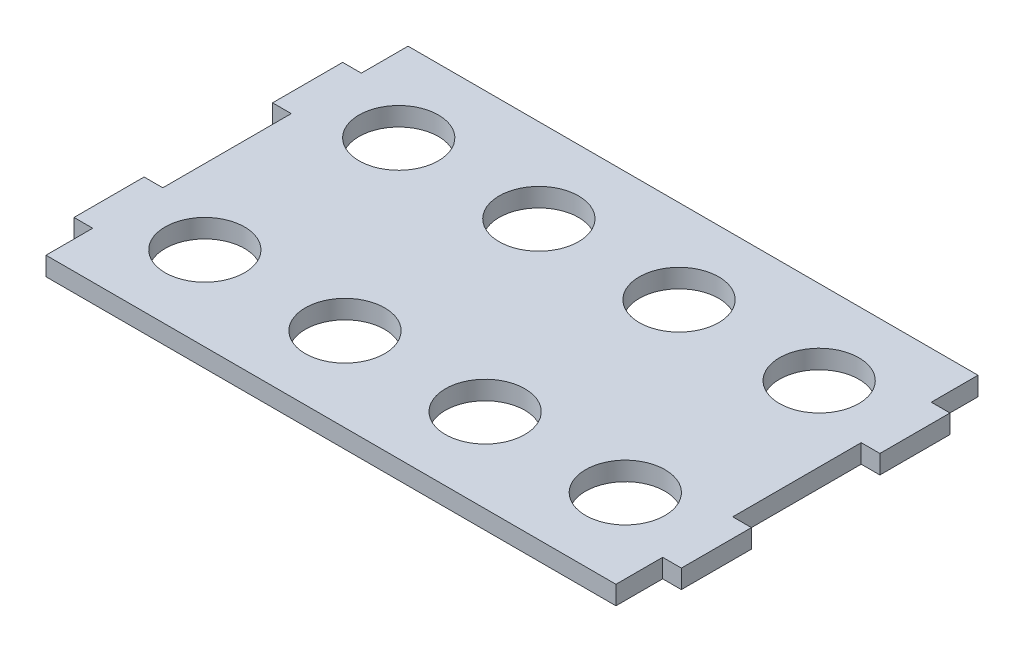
ISO-10303-21;
HEADER;
FILE_DESCRIPTION(('STEP AP214'),'2;1');
FILE_NAME('part.step','',(''),(''),'','','');
FILE_SCHEMA(('AUTOMOTIVE_DESIGN { 1 0 10303 214 1 1 1 1 }'));
ENDSEC;
DATA;
#1=APPLICATION_CONTEXT('core data for automotive mechanical design processes');
#2=APPLICATION_PROTOCOL_DEFINITION('international standard','automotive_design',2000,#1);
#3=PRODUCT_CONTEXT('',#1,'mechanical');
#4=PRODUCT('Part','Part','',(#3));
#5=PRODUCT_RELATED_PRODUCT_CATEGORY('part','',(#4));
#6=PRODUCT_DEFINITION_FORMATION('','',#4);
#7=PRODUCT_DEFINITION_CONTEXT('part definition',#1,'design');
#8=PRODUCT_DEFINITION('design','',#6,#7);
#9=PRODUCT_DEFINITION_SHAPE('','',#8);
#10=(LENGTH_UNIT() NAMED_UNIT(*) SI_UNIT(.MILLI.,.METRE.));
#11=(NAMED_UNIT(*) PLANE_ANGLE_UNIT() SI_UNIT($,.RADIAN.));
#12=(NAMED_UNIT(*) SI_UNIT($,.STERADIAN.) SOLID_ANGLE_UNIT());
#13=UNCERTAINTY_MEASURE_WITH_UNIT(LENGTH_MEASURE(1.E-05),#10,'distance_accuracy_value','');
#14=(GEOMETRIC_REPRESENTATION_CONTEXT(3) GLOBAL_UNCERTAINTY_ASSIGNED_CONTEXT((#13)) GLOBAL_UNIT_ASSIGNED_CONTEXT((#10,
#11,#12)) REPRESENTATION_CONTEXT('',''));
#15=CARTESIAN_POINT('',(0.,0.,0.));
#16=DIRECTION('',(0.,0.,1.));
#17=DIRECTION('',(1.,0.,0.));
#18=AXIS2_PLACEMENT_3D('',#15,#16,#17);
#19=CARTESIAN_POINT('',(0.,4.,0.));
#20=DIRECTION('',(0.,1.,0.));
#21=DIRECTION('',(0.,0.,1.));
#22=AXIS2_PLACEMENT_3D('',#19,#20,#21);
#23=PLANE('',#22);
#24=CARTESIAN_POINT('',(-15.,4.,-20.75));
#25=DIRECTION('',(0.,1.,0.));
#26=DIRECTION('',(0.,0.,-1.));
#27=AXIS2_PLACEMENT_3D('',#24,#25,#26);
#28=CIRCLE('',#27,8.49999999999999);
#29=CARTESIAN_POINT('',(-15.,4.,-29.25));
#30=VERTEX_POINT('',#29);
#31=EDGE_CURVE('E412',#30,#30,#28,.T.);
#32=ORIENTED_EDGE('',*,*,#31,.F.);
#33=EDGE_LOOP('',(#32));
#34=FACE_BOUND('',#33,.T.);
#35=CARTESIAN_POINT('',(45.,4.,-20.75));
#36=DIRECTION('',(0.,1.,0.));
#37=DIRECTION('',(0.,0.,1.));
#38=AXIS2_PLACEMENT_3D('',#35,#36,#37);
#39=CIRCLE('',#38,8.49999999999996);
#40=CARTESIAN_POINT('',(45.,4.,-12.25));
#41=VERTEX_POINT('',#40);
#42=EDGE_CURVE('E424',#41,#41,#39,.T.);
#43=ORIENTED_EDGE('',*,*,#42,.F.);
#44=EDGE_LOOP('',(#43));
#45=FACE_BOUND('',#44,.T.);
#46=CARTESIAN_POINT('',(45.,4.,20.75));
#47=DIRECTION('',(0.,1.,0.));
#48=DIRECTION('',(0.,0.,-1.));
#49=AXIS2_PLACEMENT_3D('',#46,#47,#48);
#50=CIRCLE('',#49,8.50000000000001);
#51=CARTESIAN_POINT('',(45.,4.,12.25));
#52=VERTEX_POINT('',#51);
#53=EDGE_CURVE('E436',#52,#52,#50,.T.);
#54=ORIENTED_EDGE('',*,*,#53,.F.);
#55=EDGE_LOOP('',(#54));
#56=FACE_BOUND('',#55,.T.);
#57=CARTESIAN_POINT('',(-45.,4.,20.75));
#58=DIRECTION('',(0.,1.,0.));
#59=DIRECTION('',(0.,0.,1.));
#60=AXIS2_PLACEMENT_3D('',#57,#58,#59);
#61=CIRCLE('',#60,8.50000000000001);
#62=CARTESIAN_POINT('',(-45.,4.,29.25));
#63=VERTEX_POINT('',#62);
#64=EDGE_CURVE('E206',#63,#63,#61,.T.);
#65=ORIENTED_EDGE('',*,*,#64,.F.);
#66=EDGE_LOOP('',(#65));
#67=FACE_BOUND('',#66,.T.);
#68=DIRECTION('',(0.,0.,-1.));
#69=VECTOR('',#68,1.);
#70=CARTESIAN_POINT('',(61.,4.,-13.75));
#71=LINE('',#70,#69);
#72=CARTESIAN_POINT('',(61.,4.,13.75));
#73=VERTEX_POINT('',#72);
#74=CARTESIAN_POINT('',(61.,4.,-13.75));
#75=VERTEX_POINT('',#74);
#76=EDGE_CURVE('E241',#73,#75,#71,.T.);
#77=ORIENTED_EDGE('',*,*,#76,.T.);
#78=DIRECTION('',(1.,0.,0.));
#79=VECTOR('',#78,1.);
#80=CARTESIAN_POINT('',(61.,4.,-13.75));
#81=LINE('',#80,#79);
#82=CARTESIAN_POINT('',(65.,4.,-13.75));
#83=VERTEX_POINT('',#82);
#84=EDGE_CURVE('E129',#75,#83,#81,.T.);
#85=ORIENTED_EDGE('',*,*,#84,.T.);
#86=DIRECTION('',(0.,0.,-1.));
#87=VECTOR('',#86,1.);
#88=CARTESIAN_POINT('',(65.,4.,-28.75));
#89=LINE('',#88,#87);
#90=CARTESIAN_POINT('',(65.,4.,-28.75));
#91=VERTEX_POINT('',#90);
#92=EDGE_CURVE('E292',#83,#91,#89,.T.);
#93=ORIENTED_EDGE('',*,*,#92,.T.);
#94=DIRECTION('',(-1.,0.,0.));
#95=VECTOR('',#94,1.);
#96=CARTESIAN_POINT('',(61.,4.,-28.75));
#97=LINE('',#96,#95);
#98=CARTESIAN_POINT('',(61.,4.,-28.75));
#99=VERTEX_POINT('',#98);
#100=EDGE_CURVE('E311',#91,#99,#97,.T.);
#101=ORIENTED_EDGE('',*,*,#100,.T.);
#102=DIRECTION('',(0.,0.,-1.));
#103=VECTOR('',#102,1.);
#104=CARTESIAN_POINT('',(61.,4.,-38.75));
#105=LINE('',#104,#103);
#106=CARTESIAN_POINT('',(61.,4.,-38.75));
#107=VERTEX_POINT('',#106);
#108=EDGE_CURVE('E308',#99,#107,#105,.T.);
#109=ORIENTED_EDGE('',*,*,#108,.T.);
#110=DIRECTION('',(-1.,0.,0.));
#111=VECTOR('',#110,1.);
#112=CARTESIAN_POINT('',(-61.,4.,-38.75));
#113=LINE('',#112,#111);
#114=CARTESIAN_POINT('',(-61.,4.,-38.75));
#115=VERTEX_POINT('',#114);
#116=EDGE_CURVE('E310',#107,#115,#113,.T.);
#117=ORIENTED_EDGE('',*,*,#116,.T.);
#118=DIRECTION('',(0.,0.,1.));
#119=VECTOR('',#118,1.);
#120=CARTESIAN_POINT('',(-61.,4.,-38.75));
#121=LINE('',#120,#119);
#122=CARTESIAN_POINT('',(-61.,4.,-28.75));
#123=VERTEX_POINT('',#122);
#124=EDGE_CURVE('E313',#115,#123,#121,.T.);
#125=ORIENTED_EDGE('',*,*,#124,.T.);
#126=DIRECTION('',(-1.,0.,0.));
#127=VECTOR('',#126,1.);
#128=CARTESIAN_POINT('',(-61.,4.,-28.75));
#129=LINE('',#128,#127);
#130=CARTESIAN_POINT('',(-65.,4.,-28.75));
#131=VERTEX_POINT('',#130);
#132=EDGE_CURVE('E319',#123,#131,#129,.T.);
#133=ORIENTED_EDGE('',*,*,#132,.T.);
#134=DIRECTION('',(0.,0.,1.));
#135=VECTOR('',#134,1.);
#136=CARTESIAN_POINT('',(-65.,4.,-28.75));
#137=LINE('',#136,#135);
#138=CARTESIAN_POINT('',(-65.,4.,-13.75));
#139=VERTEX_POINT('',#138);
#140=EDGE_CURVE('E321',#131,#139,#137,.T.);
#141=ORIENTED_EDGE('',*,*,#140,.T.);
#142=DIRECTION('',(1.,0.,0.));
#143=VECTOR('',#142,1.);
#144=CARTESIAN_POINT('',(-65.,4.,-13.75));
#145=LINE('',#144,#143);
#146=CARTESIAN_POINT('',(-61.,4.,-13.75));
#147=VERTEX_POINT('',#146);
#148=EDGE_CURVE('E323',#139,#147,#145,.T.);
#149=ORIENTED_EDGE('',*,*,#148,.T.);
#150=DIRECTION('',(0.,0.,1.));
#151=VECTOR('',#150,1.);
#152=CARTESIAN_POINT('',(-61.,4.,-13.75));
#153=LINE('',#152,#151);
#154=CARTESIAN_POINT('',(-61.,4.,13.75));
#155=VERTEX_POINT('',#154);
#156=EDGE_CURVE('E325',#147,#155,#153,.T.);
#157=ORIENTED_EDGE('',*,*,#156,.T.);
#158=DIRECTION('',(-1.,0.,0.));
#159=VECTOR('',#158,1.);
#160=CARTESIAN_POINT('',(-61.,4.,13.75));
#161=LINE('',#160,#159);
#162=CARTESIAN_POINT('',(-65.,4.,13.75));
#163=VERTEX_POINT('',#162);
#164=EDGE_CURVE('E327',#155,#163,#161,.T.);
#165=ORIENTED_EDGE('',*,*,#164,.T.);
#166=DIRECTION('',(0.,0.,1.));
#167=VECTOR('',#166,1.);
#168=CARTESIAN_POINT('',(-64.9999999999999,4.,28.75));
#169=LINE('',#168,#167);
#170=CARTESIAN_POINT('',(-64.9999999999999,4.,28.75));
#171=VERTEX_POINT('',#170);
#172=EDGE_CURVE('E329',#163,#171,#169,.T.);
#173=ORIENTED_EDGE('',*,*,#172,.T.);
#174=DIRECTION('',(1.,0.,0.));
#175=VECTOR('',#174,1.);
#176=CARTESIAN_POINT('',(-64.9999999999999,4.,28.75));
#177=LINE('',#176,#175);
#178=CARTESIAN_POINT('',(-60.9999999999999,4.,28.75));
#179=VERTEX_POINT('',#178);
#180=EDGE_CURVE('E331',#171,#179,#177,.T.);
#181=ORIENTED_EDGE('',*,*,#180,.T.);
#182=DIRECTION('',(0.,0.,1.));
#183=VECTOR('',#182,1.);
#184=CARTESIAN_POINT('',(-60.9999999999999,4.,28.75));
#185=LINE('',#184,#183);
#186=CARTESIAN_POINT('',(-61.,4.,38.75));
#187=VERTEX_POINT('',#186);
#188=EDGE_CURVE('E333',#179,#187,#185,.T.);
#189=ORIENTED_EDGE('',*,*,#188,.T.);
#190=DIRECTION('',(1.,0.,0.));
#191=VECTOR('',#190,1.);
#192=CARTESIAN_POINT('',(-61.,4.,38.75));
#193=LINE('',#192,#191);
#194=CARTESIAN_POINT('',(61.,4.,38.75));
#195=VERTEX_POINT('',#194);
#196=EDGE_CURVE('E335',#187,#195,#193,.T.);
#197=ORIENTED_EDGE('',*,*,#196,.T.);
#198=DIRECTION('',(0.,0.,-1.));
#199=VECTOR('',#198,1.);
#200=CARTESIAN_POINT('',(60.9999999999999,4.,28.75));
#201=LINE('',#200,#199);
#202=CARTESIAN_POINT('',(60.9999999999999,4.,28.75));
#203=VERTEX_POINT('',#202);
#204=EDGE_CURVE('E184',#195,#203,#201,.T.);
#205=ORIENTED_EDGE('',*,*,#204,.T.);
#206=DIRECTION('',(1.,0.,0.));
#207=VECTOR('',#206,1.);
#208=CARTESIAN_POINT('',(60.9999999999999,4.,28.75));
#209=LINE('',#208,#207);
#210=CARTESIAN_POINT('',(64.9999999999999,4.,28.75));
#211=VERTEX_POINT('',#210);
#212=EDGE_CURVE('E178',#203,#211,#209,.T.);
#213=ORIENTED_EDGE('',*,*,#212,.T.);
#214=DIRECTION('',(0.,0.,-1.));
#215=VECTOR('',#214,1.);
#216=CARTESIAN_POINT('',(64.9999999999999,4.,28.75));
#217=LINE('',#216,#215);
#218=CARTESIAN_POINT('',(65.,4.,13.75));
#219=VERTEX_POINT('',#218);
#220=EDGE_CURVE('E182',#211,#219,#217,.T.);
#221=ORIENTED_EDGE('',*,*,#220,.T.);
#222=DIRECTION('',(-1.,0.,0.));
#223=VECTOR('',#222,1.);
#224=CARTESIAN_POINT('',(61.,4.,13.75));
#225=LINE('',#224,#223);
#226=EDGE_CURVE('E50',#219,#73,#225,.T.);
#227=ORIENTED_EDGE('',*,*,#226,.T.);
#228=EDGE_LOOP('',(#77,#85,#93,#101,#109,#117,#125,#133,#141,#149,#157,#165,#173,#181,#189,#197,
#205,#213,#221,#227));
#229=FACE_BOUND('',#228,.T.);
#230=CARTESIAN_POINT('',(-15.,4.,20.75));
#231=DIRECTION('',(0.,1.,0.));
#232=DIRECTION('',(0.,0.,1.));
#233=AXIS2_PLACEMENT_3D('',#230,#231,#232);
#234=CIRCLE('',#233,8.50000000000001);
#235=CARTESIAN_POINT('',(-15.,4.,29.25));
#236=VERTEX_POINT('',#235);
#237=EDGE_CURVE('E442',#236,#236,#234,.T.);
#238=ORIENTED_EDGE('',*,*,#237,.F.);
#239=EDGE_LOOP('',(#238));
#240=FACE_BOUND('',#239,.T.);
#241=CARTESIAN_POINT('',(15.,4.,20.75));
#242=DIRECTION('',(0.,1.,0.));
#243=DIRECTION('',(0.,0.,-1.));
#244=AXIS2_PLACEMENT_3D('',#241,#242,#243);
#245=CIRCLE('',#244,8.50000000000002);
#246=CARTESIAN_POINT('',(15.,4.,12.25));
#247=VERTEX_POINT('',#246);
#248=EDGE_CURVE('E430',#247,#247,#245,.T.);
#249=ORIENTED_EDGE('',*,*,#248,.F.);
#250=EDGE_LOOP('',(#249));
#251=FACE_BOUND('',#250,.T.);
#252=CARTESIAN_POINT('',(15.,4.,-20.75));
#253=DIRECTION('',(0.,1.,0.));
#254=DIRECTION('',(0.,0.,1.));
#255=AXIS2_PLACEMENT_3D('',#252,#253,#254);
#256=CIRCLE('',#255,8.50000000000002);
#257=CARTESIAN_POINT('',(15.,4.,-12.25));
#258=VERTEX_POINT('',#257);
#259=EDGE_CURVE('E418',#258,#258,#256,.T.);
#260=ORIENTED_EDGE('',*,*,#259,.F.);
#261=EDGE_LOOP('',(#260));
#262=FACE_BOUND('',#261,.T.);
#263=CARTESIAN_POINT('',(-45.,4.,-20.75));
#264=DIRECTION('',(0.,1.,0.));
#265=DIRECTION('',(0.,0.,-1.));
#266=AXIS2_PLACEMENT_3D('',#263,#264,#265);
#267=CIRCLE('',#266,8.5);
#268=CARTESIAN_POINT('',(-45.,4.,-29.25));
#269=VERTEX_POINT('',#268);
#270=EDGE_CURVE('E403',#269,#269,#267,.T.);
#271=ORIENTED_EDGE('',*,*,#270,.F.);
#272=EDGE_LOOP('',(#271));
#273=FACE_BOUND('',#272,.T.);
#274=ADVANCED_FACE('F33',(#34,#45,#56,#67,#229,#240,#251,#262,#273),#23,.T.);
#275=CARTESIAN_POINT('',(0.,0.,0.));
#276=DIRECTION('',(0.,1.,0.));
#277=DIRECTION('',(0.,0.,1.));
#278=AXIS2_PLACEMENT_3D('',#275,#276,#277);
#279=PLANE('',#278);
#280=CARTESIAN_POINT('',(-15.,0.,-20.75));
#281=DIRECTION('',(0.,1.,0.));
#282=DIRECTION('',(0.,0.,-1.));
#283=AXIS2_PLACEMENT_3D('',#280,#281,#282);
#284=CIRCLE('',#283,8.49999999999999);
#285=CARTESIAN_POINT('',(-15.,0.,-29.25));
#286=VERTEX_POINT('',#285);
#287=EDGE_CURVE('E409',#286,#286,#284,.T.);
#288=ORIENTED_EDGE('',*,*,#287,.T.);
#289=EDGE_LOOP('',(#288));
#290=FACE_BOUND('',#289,.T.);
#291=CARTESIAN_POINT('',(45.,0.,-20.75));
#292=DIRECTION('',(0.,1.,0.));
#293=DIRECTION('',(0.,0.,1.));
#294=AXIS2_PLACEMENT_3D('',#291,#292,#293);
#295=CIRCLE('',#294,8.49999999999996);
#296=CARTESIAN_POINT('',(45.,0.,-12.25));
#297=VERTEX_POINT('',#296);
#298=EDGE_CURVE('E421',#297,#297,#295,.T.);
#299=ORIENTED_EDGE('',*,*,#298,.T.);
#300=EDGE_LOOP('',(#299));
#301=FACE_BOUND('',#300,.T.);
#302=CARTESIAN_POINT('',(45.,0.,20.75));
#303=DIRECTION('',(0.,1.,0.));
#304=DIRECTION('',(0.,0.,-1.));
#305=AXIS2_PLACEMENT_3D('',#302,#303,#304);
#306=CIRCLE('',#305,8.50000000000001);
#307=CARTESIAN_POINT('',(45.,0.,12.25));
#308=VERTEX_POINT('',#307);
#309=EDGE_CURVE('E433',#308,#308,#306,.T.);
#310=ORIENTED_EDGE('',*,*,#309,.T.);
#311=EDGE_LOOP('',(#310));
#312=FACE_BOUND('',#311,.T.);
#313=CARTESIAN_POINT('',(-45.,0.,20.75));
#314=DIRECTION('',(0.,1.,0.));
#315=DIRECTION('',(0.,0.,1.));
#316=AXIS2_PLACEMENT_3D('',#313,#314,#315);
#317=CIRCLE('',#316,8.50000000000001);
#318=CARTESIAN_POINT('',(-45.,0.,29.25));
#319=VERTEX_POINT('',#318);
#320=EDGE_CURVE('E445',#319,#319,#317,.T.);
#321=ORIENTED_EDGE('',*,*,#320,.T.);
#322=EDGE_LOOP('',(#321));
#323=FACE_BOUND('',#322,.T.);
#324=DIRECTION('',(0.,0.,-1.));
#325=VECTOR('',#324,1.);
#326=CARTESIAN_POINT('',(61.,0.,-13.75));
#327=LINE('',#326,#325);
#328=CARTESIAN_POINT('',(61.,0.,13.75));
#329=VERTEX_POINT('',#328);
#330=CARTESIAN_POINT('',(61.,0.,-13.75));
#331=VERTEX_POINT('',#330);
#332=EDGE_CURVE('E202',#329,#331,#327,.T.);
#333=ORIENTED_EDGE('',*,*,#332,.F.);
#334=DIRECTION('',(-1.,0.,0.));
#335=VECTOR('',#334,1.);
#336=CARTESIAN_POINT('',(61.,0.,13.75));
#337=LINE('',#336,#335);
#338=CARTESIAN_POINT('',(65.,0.,13.75));
#339=VERTEX_POINT('',#338);
#340=EDGE_CURVE('E121',#339,#329,#337,.T.);
#341=ORIENTED_EDGE('',*,*,#340,.F.);
#342=DIRECTION('',(0.,0.,-1.));
#343=VECTOR('',#342,1.);
#344=CARTESIAN_POINT('',(64.9999999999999,0.,28.75));
#345=LINE('',#344,#343);
#346=CARTESIAN_POINT('',(64.9999999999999,0.,28.75));
#347=VERTEX_POINT('',#346);
#348=EDGE_CURVE('E115',#347,#339,#345,.T.);
#349=ORIENTED_EDGE('',*,*,#348,.F.);
#350=DIRECTION('',(1.,0.,0.));
#351=VECTOR('',#350,1.);
#352=CARTESIAN_POINT('',(60.9999999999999,0.,28.75));
#353=LINE('',#352,#351);
#354=CARTESIAN_POINT('',(60.9999999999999,0.,28.75));
#355=VERTEX_POINT('',#354);
#356=EDGE_CURVE('E192',#355,#347,#353,.T.);
#357=ORIENTED_EDGE('',*,*,#356,.F.);
#358=DIRECTION('',(0.,0.,-1.));
#359=VECTOR('',#358,1.);
#360=CARTESIAN_POINT('',(60.9999999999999,0.,28.75));
#361=LINE('',#360,#359);
#362=CARTESIAN_POINT('',(61.,0.,38.75));
#363=VERTEX_POINT('',#362);
#364=EDGE_CURVE('E236',#363,#355,#361,.T.);
#365=ORIENTED_EDGE('',*,*,#364,.F.);
#366=DIRECTION('',(1.,0.,0.));
#367=VECTOR('',#366,1.);
#368=CARTESIAN_POINT('',(-61.,0.,38.75));
#369=LINE('',#368,#367);
#370=CARTESIAN_POINT('',(-61.,0.,38.75));
#371=VERTEX_POINT('',#370);
#372=EDGE_CURVE('E234',#371,#363,#369,.T.);
#373=ORIENTED_EDGE('',*,*,#372,.F.);
#374=DIRECTION('',(0.,0.,1.));
#375=VECTOR('',#374,1.);
#376=CARTESIAN_POINT('',(-60.9999999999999,0.,28.75));
#377=LINE('',#376,#375);
#378=CARTESIAN_POINT('',(-60.9999999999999,0.,28.75));
#379=VERTEX_POINT('',#378);
#380=EDGE_CURVE('E232',#379,#371,#377,.T.);
#381=ORIENTED_EDGE('',*,*,#380,.F.);
#382=DIRECTION('',(1.,0.,0.));
#383=VECTOR('',#382,1.);
#384=CARTESIAN_POINT('',(-64.9999999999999,0.,28.75));
#385=LINE('',#384,#383);
#386=CARTESIAN_POINT('',(-64.9999999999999,0.,28.75));
#387=VERTEX_POINT('',#386);
#388=EDGE_CURVE('E230',#387,#379,#385,.T.);
#389=ORIENTED_EDGE('',*,*,#388,.F.);
#390=DIRECTION('',(0.,0.,1.));
#391=VECTOR('',#390,1.);
#392=CARTESIAN_POINT('',(-64.9999999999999,0.,28.75));
#393=LINE('',#392,#391);
#394=CARTESIAN_POINT('',(-65.,0.,13.75));
#395=VERTEX_POINT('',#394);
#396=EDGE_CURVE('E228',#395,#387,#393,.T.);
#397=ORIENTED_EDGE('',*,*,#396,.F.);
#398=DIRECTION('',(-1.,0.,0.));
#399=VECTOR('',#398,1.);
#400=CARTESIAN_POINT('',(-61.,0.,13.75));
#401=LINE('',#400,#399);
#402=CARTESIAN_POINT('',(-61.,0.,13.75));
#403=VERTEX_POINT('',#402);
#404=EDGE_CURVE('E226',#403,#395,#401,.T.);
#405=ORIENTED_EDGE('',*,*,#404,.F.);
#406=DIRECTION('',(0.,0.,1.));
#407=VECTOR('',#406,1.);
#408=CARTESIAN_POINT('',(-61.,0.,-13.75));
#409=LINE('',#408,#407);
#410=CARTESIAN_POINT('',(-61.,0.,-13.75));
#411=VERTEX_POINT('',#410);
#412=EDGE_CURVE('E224',#411,#403,#409,.T.);
#413=ORIENTED_EDGE('',*,*,#412,.F.);
#414=DIRECTION('',(1.,0.,0.));
#415=VECTOR('',#414,1.);
#416=CARTESIAN_POINT('',(-65.,0.,-13.75));
#417=LINE('',#416,#415);
#418=CARTESIAN_POINT('',(-65.,0.,-13.75));
#419=VERTEX_POINT('',#418);
#420=EDGE_CURVE('E222',#419,#411,#417,.T.);
#421=ORIENTED_EDGE('',*,*,#420,.F.);
#422=DIRECTION('',(0.,0.,1.));
#423=VECTOR('',#422,1.);
#424=CARTESIAN_POINT('',(-65.,0.,-28.75));
#425=LINE('',#424,#423);
#426=CARTESIAN_POINT('',(-65.,0.,-28.75));
#427=VERTEX_POINT('',#426);
#428=EDGE_CURVE('E220',#427,#419,#425,.T.);
#429=ORIENTED_EDGE('',*,*,#428,.F.);
#430=DIRECTION('',(-1.,0.,0.));
#431=VECTOR('',#430,1.);
#432=CARTESIAN_POINT('',(-61.,0.,-28.75));
#433=LINE('',#432,#431);
#434=CARTESIAN_POINT('',(-61.,0.,-28.75));
#435=VERTEX_POINT('',#434);
#436=EDGE_CURVE('E218',#435,#427,#433,.T.);
#437=ORIENTED_EDGE('',*,*,#436,.F.);
#438=DIRECTION('',(0.,0.,1.));
#439=VECTOR('',#438,1.);
#440=CARTESIAN_POINT('',(-61.,0.,-38.75));
#441=LINE('',#440,#439);
#442=CARTESIAN_POINT('',(-61.,0.,-38.75));
#443=VERTEX_POINT('',#442);
#444=EDGE_CURVE('E216',#443,#435,#441,.T.);
#445=ORIENTED_EDGE('',*,*,#444,.F.);
#446=DIRECTION('',(-1.,0.,0.));
#447=VECTOR('',#446,1.);
#448=CARTESIAN_POINT('',(-61.,0.,-38.75));
#449=LINE('',#448,#447);
#450=CARTESIAN_POINT('',(61.,0.,-38.75));
#451=VERTEX_POINT('',#450);
#452=EDGE_CURVE('E214',#451,#443,#449,.T.);
#453=ORIENTED_EDGE('',*,*,#452,.F.);
#454=DIRECTION('',(0.,0.,-1.));
#455=VECTOR('',#454,1.);
#456=CARTESIAN_POINT('',(61.,0.,-38.75));
#457=LINE('',#456,#455);
#458=CARTESIAN_POINT('',(61.,0.,-28.75));
#459=VERTEX_POINT('',#458);
#460=EDGE_CURVE('E212',#459,#451,#457,.T.);
#461=ORIENTED_EDGE('',*,*,#460,.F.);
#462=DIRECTION('',(-1.,0.,0.));
#463=VECTOR('',#462,1.);
#464=CARTESIAN_POINT('',(61.,0.,-28.75));
#465=LINE('',#464,#463);
#466=CARTESIAN_POINT('',(65.,0.,-28.75));
#467=VERTEX_POINT('',#466);
#468=EDGE_CURVE('E210',#467,#459,#465,.T.);
#469=ORIENTED_EDGE('',*,*,#468,.F.);
#470=DIRECTION('',(0.,0.,-1.));
#471=VECTOR('',#470,1.);
#472=CARTESIAN_POINT('',(65.,0.,-28.75));
#473=LINE('',#472,#471);
#474=CARTESIAN_POINT('',(65.,0.,-13.75));
#475=VERTEX_POINT('',#474);
#476=EDGE_CURVE('E208',#475,#467,#473,.T.);
#477=ORIENTED_EDGE('',*,*,#476,.F.);
#478=DIRECTION('',(1.,0.,0.));
#479=VECTOR('',#478,1.);
#480=CARTESIAN_POINT('',(61.,0.,-13.75));
#481=LINE('',#480,#479);
#482=EDGE_CURVE('E205',#331,#475,#481,.T.);
#483=ORIENTED_EDGE('',*,*,#482,.F.);
#484=EDGE_LOOP('',(#333,#341,#349,#357,#365,#373,#381,#389,#397,#405,#413,#421,#429,#437,#445,
#453,#461,#469,#477,#483));
#485=FACE_BOUND('',#484,.T.);
#486=CARTESIAN_POINT('',(-15.,0.,20.75));
#487=DIRECTION('',(0.,1.,0.));
#488=DIRECTION('',(0.,0.,1.));
#489=AXIS2_PLACEMENT_3D('',#486,#487,#488);
#490=CIRCLE('',#489,8.50000000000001);
#491=CARTESIAN_POINT('',(-15.,0.,29.25));
#492=VERTEX_POINT('',#491);
#493=EDGE_CURVE('E439',#492,#492,#490,.T.);
#494=ORIENTED_EDGE('',*,*,#493,.T.);
#495=EDGE_LOOP('',(#494));
#496=FACE_BOUND('',#495,.T.);
#497=CARTESIAN_POINT('',(15.,0.,20.75));
#498=DIRECTION('',(0.,1.,0.));
#499=DIRECTION('',(0.,0.,-1.));
#500=AXIS2_PLACEMENT_3D('',#497,#498,#499);
#501=CIRCLE('',#500,8.50000000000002);
#502=CARTESIAN_POINT('',(15.,0.,12.25));
#503=VERTEX_POINT('',#502);
#504=EDGE_CURVE('E427',#503,#503,#501,.T.);
#505=ORIENTED_EDGE('',*,*,#504,.T.);
#506=EDGE_LOOP('',(#505));
#507=FACE_BOUND('',#506,.T.);
#508=CARTESIAN_POINT('',(15.,0.,-20.75));
#509=DIRECTION('',(0.,1.,0.));
#510=DIRECTION('',(0.,0.,1.));
#511=AXIS2_PLACEMENT_3D('',#508,#509,#510);
#512=CIRCLE('',#511,8.50000000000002);
#513=CARTESIAN_POINT('',(15.,0.,-12.25));
#514=VERTEX_POINT('',#513);
#515=EDGE_CURVE('E415',#514,#514,#512,.T.);
#516=ORIENTED_EDGE('',*,*,#515,.T.);
#517=EDGE_LOOP('',(#516));
#518=FACE_BOUND('',#517,.T.);
#519=CARTESIAN_POINT('',(-45.,0.,-20.75));
#520=DIRECTION('',(0.,1.,0.));
#521=DIRECTION('',(0.,0.,-1.));
#522=AXIS2_PLACEMENT_3D('',#519,#520,#521);
#523=CIRCLE('',#522,8.5);
#524=CARTESIAN_POINT('',(-45.,0.,-29.25));
#525=VERTEX_POINT('',#524);
#526=EDGE_CURVE('E406',#525,#525,#523,.T.);
#527=ORIENTED_EDGE('',*,*,#526,.T.);
#528=EDGE_LOOP('',(#527));
#529=FACE_BOUND('',#528,.T.);
#530=ADVANCED_FACE('F296',(#290,#301,#312,#323,#485,#496,#507,#518,#529),#279,.F.);
#531=CARTESIAN_POINT('',(61.,4.,-13.75));
#532=DIRECTION('',(-1.,0.,0.));
#533=DIRECTION('',(0.,0.,1.));
#534=AXIS2_PLACEMENT_3D('',#531,#532,#533);
#535=PLANE('',#534);
#536=ORIENTED_EDGE('',*,*,#332,.T.);
#537=DIRECTION('',(0.,-1.,0.));
#538=VECTOR('',#537,1.);
#539=CARTESIAN_POINT('',(61.,4.,-13.75));
#540=LINE('',#539,#538);
#541=EDGE_CURVE('E11',#75,#331,#540,.T.);
#542=ORIENTED_EDGE('',*,*,#541,.F.);
#543=ORIENTED_EDGE('',*,*,#76,.F.);
#544=DIRECTION('',(0.,-1.,0.));
#545=VECTOR('',#544,1.);
#546=CARTESIAN_POINT('',(61.,4.,13.75));
#547=LINE('',#546,#545);
#548=EDGE_CURVE('E198',#73,#329,#547,.T.);
#549=ORIENTED_EDGE('',*,*,#548,.T.);
#550=EDGE_LOOP('',(#536,#542,#543,#549));
#551=FACE_BOUND('',#550,.T.);
#552=ADVANCED_FACE('F35',(#551),#535,.F.);
#553=CARTESIAN_POINT('',(61.,4.,-13.75));
#554=DIRECTION('',(0.,0.,-1.));
#555=DIRECTION('',(-1.,0.,0.));
#556=AXIS2_PLACEMENT_3D('',#553,#554,#555);
#557=PLANE('',#556);
#558=ORIENTED_EDGE('',*,*,#482,.T.);
#559=DIRECTION('',(0.,-1.,0.));
#560=VECTOR('',#559,1.);
#561=CARTESIAN_POINT('',(65.,4.,-13.75));
#562=LINE('',#561,#560);
#563=EDGE_CURVE('E42',#83,#475,#562,.T.);
#564=ORIENTED_EDGE('',*,*,#563,.F.);
#565=ORIENTED_EDGE('',*,*,#84,.F.);
#566=ORIENTED_EDGE('',*,*,#541,.T.);
#567=EDGE_LOOP('',(#558,#564,#565,#566));
#568=FACE_BOUND('',#567,.T.);
#569=ADVANCED_FACE('F670',(#568),#557,.F.);
#570=CARTESIAN_POINT('',(65.,4.,-28.75));
#571=DIRECTION('',(-1.,0.,0.));
#572=DIRECTION('',(0.,0.,1.));
#573=AXIS2_PLACEMENT_3D('',#570,#571,#572);
#574=PLANE('',#573);
#575=ORIENTED_EDGE('',*,*,#476,.T.);
#576=DIRECTION('',(0.,-1.,0.));
#577=VECTOR('',#576,1.);
#578=CARTESIAN_POINT('',(65.,4.,-28.75));
#579=LINE('',#578,#577);
#580=EDGE_CURVE('E284',#91,#467,#579,.T.);
#581=ORIENTED_EDGE('',*,*,#580,.F.);
#582=ORIENTED_EDGE('',*,*,#92,.F.);
#583=ORIENTED_EDGE('',*,*,#563,.T.);
#584=EDGE_LOOP('',(#575,#581,#582,#583));
#585=FACE_BOUND('',#584,.T.);
#586=ADVANCED_FACE('F290',(#585),#574,.F.);
#587=CARTESIAN_POINT('',(61.,4.,-28.75));
#588=DIRECTION('',(0.,0.,1.));
#589=DIRECTION('',(1.,0.,0.));
#590=AXIS2_PLACEMENT_3D('',#587,#588,#589);
#591=PLANE('',#590);
#592=ORIENTED_EDGE('',*,*,#468,.T.);
#593=DIRECTION('',(0.,-1.,0.));
#594=VECTOR('',#593,1.);
#595=CARTESIAN_POINT('',(61.,4.,-28.75));
#596=LINE('',#595,#594);
#597=EDGE_CURVE('E281',#99,#459,#596,.T.);
#598=ORIENTED_EDGE('',*,*,#597,.F.);
#599=ORIENTED_EDGE('',*,*,#100,.F.);
#600=ORIENTED_EDGE('',*,*,#580,.T.);
#601=EDGE_LOOP('',(#592,#598,#599,#600));
#602=FACE_BOUND('',#601,.T.);
#603=ADVANCED_FACE('F302',(#602),#591,.F.);
#604=CARTESIAN_POINT('',(61.,4.,-38.75));
#605=DIRECTION('',(-1.,0.,0.));
#606=DIRECTION('',(0.,0.,1.));
#607=AXIS2_PLACEMENT_3D('',#604,#605,#606);
#608=PLANE('',#607);
#609=ORIENTED_EDGE('',*,*,#460,.T.);
#610=DIRECTION('',(0.,-1.,0.));
#611=VECTOR('',#610,1.);
#612=CARTESIAN_POINT('',(61.,4.,-38.75));
#613=LINE('',#612,#611);
#614=EDGE_CURVE('E278',#107,#451,#613,.T.);
#615=ORIENTED_EDGE('',*,*,#614,.F.);
#616=ORIENTED_EDGE('',*,*,#108,.F.);
#617=ORIENTED_EDGE('',*,*,#597,.T.);
#618=EDGE_LOOP('',(#609,#615,#616,#617));
#619=FACE_BOUND('',#618,.T.);
#620=ADVANCED_FACE('F306',(#619),#608,.F.);
#621=CARTESIAN_POINT('',(-61.,4.,-38.75));
#622=DIRECTION('',(0.,0.,1.));
#623=DIRECTION('',(1.,0.,0.));
#624=AXIS2_PLACEMENT_3D('',#621,#622,#623);
#625=PLANE('',#624);
#626=ORIENTED_EDGE('',*,*,#452,.T.);
#627=DIRECTION('',(0.,-1.,0.));
#628=VECTOR('',#627,1.);
#629=CARTESIAN_POINT('',(-61.,4.,-38.75));
#630=LINE('',#629,#628);
#631=EDGE_CURVE('E275',#115,#443,#630,.T.);
#632=ORIENTED_EDGE('',*,*,#631,.F.);
#633=ORIENTED_EDGE('',*,*,#116,.F.);
#634=ORIENTED_EDGE('',*,*,#614,.T.);
#635=EDGE_LOOP('',(#626,#632,#633,#634));
#636=FACE_BOUND('',#635,.T.);
#637=ADVANCED_FACE('F635',(#636),#625,.F.);
#638=CARTESIAN_POINT('',(-61.,4.,-38.75));
#639=DIRECTION('',(1.,0.,0.));
#640=DIRECTION('',(0.,0.,-1.));
#641=AXIS2_PLACEMENT_3D('',#638,#639,#640);
#642=PLANE('',#641);
#643=ORIENTED_EDGE('',*,*,#444,.T.);
#644=DIRECTION('',(0.,-1.,0.));
#645=VECTOR('',#644,1.);
#646=CARTESIAN_POINT('',(-61.,4.,-28.75));
#647=LINE('',#646,#645);
#648=EDGE_CURVE('E272',#123,#435,#647,.T.);
#649=ORIENTED_EDGE('',*,*,#648,.F.);
#650=ORIENTED_EDGE('',*,*,#124,.F.);
#651=ORIENTED_EDGE('',*,*,#631,.T.);
#652=EDGE_LOOP('',(#643,#649,#650,#651));
#653=FACE_BOUND('',#652,.T.);
#654=ADVANCED_FACE('F625',(#653),#642,.F.);
#655=CARTESIAN_POINT('',(-61.,4.,-28.75));
#656=DIRECTION('',(0.,0.,1.));
#657=DIRECTION('',(1.,0.,0.));
#658=AXIS2_PLACEMENT_3D('',#655,#656,#657);
#659=PLANE('',#658);
#660=ORIENTED_EDGE('',*,*,#436,.T.);
#661=DIRECTION('',(0.,-1.,0.));
#662=VECTOR('',#661,1.);
#663=CARTESIAN_POINT('',(-65.,4.,-28.75));
#664=LINE('',#663,#662);
#665=EDGE_CURVE('E269',#131,#427,#664,.T.);
#666=ORIENTED_EDGE('',*,*,#665,.F.);
#667=ORIENTED_EDGE('',*,*,#132,.F.);
#668=ORIENTED_EDGE('',*,*,#648,.T.);
#669=EDGE_LOOP('',(#660,#666,#667,#668));
#670=FACE_BOUND('',#669,.T.);
#671=ADVANCED_FACE('F615',(#670),#659,.F.);
#672=CARTESIAN_POINT('',(-65.,4.,-28.75));
#673=DIRECTION('',(1.,0.,0.));
#674=DIRECTION('',(0.,0.,-1.));
#675=AXIS2_PLACEMENT_3D('',#672,#673,#674);
#676=PLANE('',#675);
#677=ORIENTED_EDGE('',*,*,#428,.T.);
#678=DIRECTION('',(0.,-1.,0.));
#679=VECTOR('',#678,1.);
#680=CARTESIAN_POINT('',(-65.,4.,-13.75));
#681=LINE('',#680,#679);
#682=EDGE_CURVE('E266',#139,#419,#681,.T.);
#683=ORIENTED_EDGE('',*,*,#682,.F.);
#684=ORIENTED_EDGE('',*,*,#140,.F.);
#685=ORIENTED_EDGE('',*,*,#665,.T.);
#686=EDGE_LOOP('',(#677,#683,#684,#685));
#687=FACE_BOUND('',#686,.T.);
#688=ADVANCED_FACE('F605',(#687),#676,.F.);
#689=CARTESIAN_POINT('',(-65.,4.,-13.75));
#690=DIRECTION('',(0.,0.,-1.));
#691=DIRECTION('',(-1.,0.,0.));
#692=AXIS2_PLACEMENT_3D('',#689,#690,#691);
#693=PLANE('',#692);
#694=ORIENTED_EDGE('',*,*,#420,.T.);
#695=DIRECTION('',(0.,-1.,0.));
#696=VECTOR('',#695,1.);
#697=CARTESIAN_POINT('',(-61.,4.,-13.75));
#698=LINE('',#697,#696);
#699=EDGE_CURVE('E263',#147,#411,#698,.T.);
#700=ORIENTED_EDGE('',*,*,#699,.F.);
#701=ORIENTED_EDGE('',*,*,#148,.F.);
#702=ORIENTED_EDGE('',*,*,#682,.T.);
#703=EDGE_LOOP('',(#694,#700,#701,#702));
#704=FACE_BOUND('',#703,.T.);
#705=ADVANCED_FACE('F595',(#704),#693,.F.);
#706=CARTESIAN_POINT('',(-61.,4.,-13.75));
#707=DIRECTION('',(1.,0.,0.));
#708=DIRECTION('',(0.,0.,-1.));
#709=AXIS2_PLACEMENT_3D('',#706,#707,#708);
#710=PLANE('',#709);
#711=ORIENTED_EDGE('',*,*,#412,.T.);
#712=DIRECTION('',(0.,-1.,0.));
#713=VECTOR('',#712,1.);
#714=CARTESIAN_POINT('',(-61.,4.,13.75));
#715=LINE('',#714,#713);
#716=EDGE_CURVE('E260',#155,#403,#715,.T.);
#717=ORIENTED_EDGE('',*,*,#716,.F.);
#718=ORIENTED_EDGE('',*,*,#156,.F.);
#719=ORIENTED_EDGE('',*,*,#699,.T.);
#720=EDGE_LOOP('',(#711,#717,#718,#719));
#721=FACE_BOUND('',#720,.T.);
#722=ADVANCED_FACE('F585',(#721),#710,.F.);
#723=CARTESIAN_POINT('',(-61.,4.,13.75));
#724=DIRECTION('',(0.,0.,1.));
#725=DIRECTION('',(1.,0.,0.));
#726=AXIS2_PLACEMENT_3D('',#723,#724,#725);
#727=PLANE('',#726);
#728=ORIENTED_EDGE('',*,*,#404,.T.);
#729=DIRECTION('',(0.,-1.,0.));
#730=VECTOR('',#729,1.);
#731=CARTESIAN_POINT('',(-65.,4.,13.75));
#732=LINE('',#731,#730);
#733=EDGE_CURVE('E257',#163,#395,#732,.T.);
#734=ORIENTED_EDGE('',*,*,#733,.F.);
#735=ORIENTED_EDGE('',*,*,#164,.F.);
#736=ORIENTED_EDGE('',*,*,#716,.T.);
#737=EDGE_LOOP('',(#728,#734,#735,#736));
#738=FACE_BOUND('',#737,.T.);
#739=ADVANCED_FACE('F575',(#738),#727,.F.);
#740=CARTESIAN_POINT('',(-64.9999999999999,4.,28.75));
#741=DIRECTION('',(1.,0.,0.));
#742=DIRECTION('',(0.,0.,-1.));
#743=AXIS2_PLACEMENT_3D('',#740,#741,#742);
#744=PLANE('',#743);
#745=ORIENTED_EDGE('',*,*,#396,.T.);
#746=DIRECTION('',(0.,-1.,0.));
#747=VECTOR('',#746,1.);
#748=CARTESIAN_POINT('',(-64.9999999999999,4.,28.75));
#749=LINE('',#748,#747);
#750=EDGE_CURVE('E254',#171,#387,#749,.T.);
#751=ORIENTED_EDGE('',*,*,#750,.F.);
#752=ORIENTED_EDGE('',*,*,#172,.F.);
#753=ORIENTED_EDGE('',*,*,#733,.T.);
#754=EDGE_LOOP('',(#745,#751,#752,#753));
#755=FACE_BOUND('',#754,.T.);
#756=ADVANCED_FACE('F565',(#755),#744,.F.);
#757=CARTESIAN_POINT('',(-64.9999999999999,4.,28.75));
#758=DIRECTION('',(0.,0.,-1.));
#759=DIRECTION('',(-1.,0.,0.));
#760=AXIS2_PLACEMENT_3D('',#757,#758,#759);
#761=PLANE('',#760);
#762=ORIENTED_EDGE('',*,*,#388,.T.);
#763=DIRECTION('',(0.,-1.,0.));
#764=VECTOR('',#763,1.);
#765=CARTESIAN_POINT('',(-60.9999999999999,4.,28.75));
#766=LINE('',#765,#764);
#767=EDGE_CURVE('E251',#179,#379,#766,.T.);
#768=ORIENTED_EDGE('',*,*,#767,.F.);
#769=ORIENTED_EDGE('',*,*,#180,.F.);
#770=ORIENTED_EDGE('',*,*,#750,.T.);
#771=EDGE_LOOP('',(#762,#768,#769,#770));
#772=FACE_BOUND('',#771,.T.);
#773=ADVANCED_FACE('F555',(#772),#761,.F.);
#774=CARTESIAN_POINT('',(-60.9999999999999,4.,28.75));
#775=DIRECTION('',(1.,0.,0.));
#776=DIRECTION('',(0.,0.,-1.));
#777=AXIS2_PLACEMENT_3D('',#774,#775,#776);
#778=PLANE('',#777);
#779=ORIENTED_EDGE('',*,*,#380,.T.);
#780=DIRECTION('',(0.,-1.,0.));
#781=VECTOR('',#780,1.);
#782=CARTESIAN_POINT('',(-61.,4.,38.75));
#783=LINE('',#782,#781);
#784=EDGE_CURVE('E248',#187,#371,#783,.T.);
#785=ORIENTED_EDGE('',*,*,#784,.F.);
#786=ORIENTED_EDGE('',*,*,#188,.F.);
#787=ORIENTED_EDGE('',*,*,#767,.T.);
#788=EDGE_LOOP('',(#779,#785,#786,#787));
#789=FACE_BOUND('',#788,.T.);
#790=ADVANCED_FACE('F546',(#789),#778,.F.);
#791=CARTESIAN_POINT('',(-61.,4.,38.75));
#792=DIRECTION('',(0.,0.,-1.));
#793=DIRECTION('',(-1.,0.,0.));
#794=AXIS2_PLACEMENT_3D('',#791,#792,#793);
#795=PLANE('',#794);
#796=ORIENTED_EDGE('',*,*,#372,.T.);
#797=DIRECTION('',(0.,-1.,0.));
#798=VECTOR('',#797,1.);
#799=CARTESIAN_POINT('',(61.,4.,38.75));
#800=LINE('',#799,#798);
#801=EDGE_CURVE('E245',#195,#363,#800,.T.);
#802=ORIENTED_EDGE('',*,*,#801,.F.);
#803=ORIENTED_EDGE('',*,*,#196,.F.);
#804=ORIENTED_EDGE('',*,*,#784,.T.);
#805=EDGE_LOOP('',(#796,#802,#803,#804));
#806=FACE_BOUND('',#805,.T.);
#807=ADVANCED_FACE('F341',(#806),#795,.F.);
#808=CARTESIAN_POINT('',(60.9999999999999,4.,28.75));
#809=DIRECTION('',(-1.,0.,0.));
#810=DIRECTION('',(0.,0.,1.));
#811=AXIS2_PLACEMENT_3D('',#808,#809,#810);
#812=PLANE('',#811);
#813=ORIENTED_EDGE('',*,*,#364,.T.);
#814=DIRECTION('',(0.,-1.,0.));
#815=VECTOR('',#814,1.);
#816=CARTESIAN_POINT('',(60.9999999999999,4.,28.75));
#817=LINE('',#816,#815);
#818=EDGE_CURVE('E193',#203,#355,#817,.T.);
#819=ORIENTED_EDGE('',*,*,#818,.F.);
#820=ORIENTED_EDGE('',*,*,#204,.F.);
#821=ORIENTED_EDGE('',*,*,#801,.T.);
#822=EDGE_LOOP('',(#813,#819,#820,#821));
#823=FACE_BOUND('',#822,.T.);
#824=ADVANCED_FACE('F345',(#823),#812,.F.);
#825=CARTESIAN_POINT('',(60.9999999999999,4.,28.75));
#826=DIRECTION('',(0.,0.,-1.));
#827=DIRECTION('',(-1.,0.,0.));
#828=AXIS2_PLACEMENT_3D('',#825,#826,#827);
#829=PLANE('',#828);
#830=ORIENTED_EDGE('',*,*,#356,.T.);
#831=DIRECTION('',(0.,-1.,0.));
#832=VECTOR('',#831,1.);
#833=CARTESIAN_POINT('',(64.9999999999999,4.,28.75));
#834=LINE('',#833,#832);
#835=EDGE_CURVE('E189',#211,#347,#834,.T.);
#836=ORIENTED_EDGE('',*,*,#835,.F.);
#837=ORIENTED_EDGE('',*,*,#212,.F.);
#838=ORIENTED_EDGE('',*,*,#818,.T.);
#839=EDGE_LOOP('',(#830,#836,#837,#838));
#840=FACE_BOUND('',#839,.T.);
#841=ADVANCED_FACE('F190',(#840),#829,.F.);
#842=CARTESIAN_POINT('',(64.9999999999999,4.,28.75));
#843=DIRECTION('',(-1.,0.,0.));
#844=DIRECTION('',(0.,0.,1.));
#845=AXIS2_PLACEMENT_3D('',#842,#843,#844);
#846=PLANE('',#845);
#847=ORIENTED_EDGE('',*,*,#348,.T.);
#848=DIRECTION('',(0.,-1.,0.));
#849=VECTOR('',#848,1.);
#850=CARTESIAN_POINT('',(65.,4.,13.75));
#851=LINE('',#850,#849);
#852=EDGE_CURVE('E194',#219,#339,#851,.T.);
#853=ORIENTED_EDGE('',*,*,#852,.F.);
#854=ORIENTED_EDGE('',*,*,#220,.F.);
#855=ORIENTED_EDGE('',*,*,#835,.T.);
#856=EDGE_LOOP('',(#847,#853,#854,#855));
#857=FACE_BOUND('',#856,.T.);
#858=ADVANCED_FACE('F196',(#857),#846,.F.);
#859=CARTESIAN_POINT('',(61.,4.,13.75));
#860=DIRECTION('',(0.,0.,1.));
#861=DIRECTION('',(1.,0.,0.));
#862=AXIS2_PLACEMENT_3D('',#859,#860,#861);
#863=PLANE('',#862);
#864=ORIENTED_EDGE('',*,*,#340,.T.);
#865=ORIENTED_EDGE('',*,*,#548,.F.);
#866=ORIENTED_EDGE('',*,*,#226,.F.);
#867=ORIENTED_EDGE('',*,*,#852,.T.);
#868=EDGE_LOOP('',(#864,#865,#866,#867));
#869=FACE_BOUND('',#868,.T.);
#870=ADVANCED_FACE('F349',(#869),#863,.F.);
#871=CARTESIAN_POINT('',(-45.,4.,20.75));
#872=DIRECTION('',(0.,-1.,0.));
#873=DIRECTION('',(0.,0.,-1.));
#874=AXIS2_PLACEMENT_3D('',#871,#872,#873);
#875=CYLINDRICAL_SURFACE('',#874,8.50000000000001);
#876=ORIENTED_EDGE('',*,*,#64,.T.);
#877=EDGE_LOOP('',(#876));
#878=FACE_BOUND('',#877,.T.);
#879=ORIENTED_EDGE('',*,*,#320,.F.);
#880=EDGE_LOOP('',(#879));
#881=FACE_BOUND('',#880,.T.);
#882=ADVANCED_FACE('F351',(#878,#881),#875,.F.);
#883=CARTESIAN_POINT('',(-15.,4.,20.75));
#884=DIRECTION('',(0.,-1.,0.));
#885=DIRECTION('',(0.,0.,-1.));
#886=AXIS2_PLACEMENT_3D('',#883,#884,#885);
#887=CYLINDRICAL_SURFACE('',#886,8.50000000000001);
#888=ORIENTED_EDGE('',*,*,#237,.T.);
#889=EDGE_LOOP('',(#888));
#890=FACE_BOUND('',#889,.T.);
#891=ORIENTED_EDGE('',*,*,#493,.F.);
#892=EDGE_LOOP('',(#891));
#893=FACE_BOUND('',#892,.T.);
#894=ADVANCED_FACE('F357',(#890,#893),#887,.F.);
#895=CARTESIAN_POINT('',(45.,4.,20.75));
#896=DIRECTION('',(0.,-1.,0.));
#897=DIRECTION('',(0.,0.,-1.));
#898=AXIS2_PLACEMENT_3D('',#895,#896,#897);
#899=CYLINDRICAL_SURFACE('',#898,8.50000000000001);
#900=ORIENTED_EDGE('',*,*,#53,.T.);
#901=EDGE_LOOP('',(#900));
#902=FACE_BOUND('',#901,.T.);
#903=ORIENTED_EDGE('',*,*,#309,.F.);
#904=EDGE_LOOP('',(#903));
#905=FACE_BOUND('',#904,.T.);
#906=ADVANCED_FACE('F374',(#902,#905),#899,.F.);
#907=CARTESIAN_POINT('',(15.,4.,20.75));
#908=DIRECTION('',(0.,-1.,0.));
#909=DIRECTION('',(0.,0.,-1.));
#910=AXIS2_PLACEMENT_3D('',#907,#908,#909);
#911=CYLINDRICAL_SURFACE('',#910,8.50000000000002);
#912=ORIENTED_EDGE('',*,*,#248,.T.);
#913=EDGE_LOOP('',(#912));
#914=FACE_BOUND('',#913,.T.);
#915=ORIENTED_EDGE('',*,*,#504,.F.);
#916=EDGE_LOOP('',(#915));
#917=FACE_BOUND('',#916,.T.);
#918=ADVANCED_FACE('F378',(#914,#917),#911,.F.);
#919=CARTESIAN_POINT('',(45.,4.,-20.75));
#920=DIRECTION('',(0.,-1.,0.));
#921=DIRECTION('',(0.,0.,-1.));
#922=AXIS2_PLACEMENT_3D('',#919,#920,#921);
#923=CYLINDRICAL_SURFACE('',#922,8.49999999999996);
#924=ORIENTED_EDGE('',*,*,#42,.T.);
#925=EDGE_LOOP('',(#924));
#926=FACE_BOUND('',#925,.T.);
#927=ORIENTED_EDGE('',*,*,#298,.F.);
#928=EDGE_LOOP('',(#927));
#929=FACE_BOUND('',#928,.T.);
#930=ADVANCED_FACE('F382',(#926,#929),#923,.F.);
#931=CARTESIAN_POINT('',(15.,4.,-20.75));
#932=DIRECTION('',(0.,-1.,0.));
#933=DIRECTION('',(0.,0.,-1.));
#934=AXIS2_PLACEMENT_3D('',#931,#932,#933);
#935=CYLINDRICAL_SURFACE('',#934,8.50000000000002);
#936=ORIENTED_EDGE('',*,*,#259,.T.);
#937=EDGE_LOOP('',(#936));
#938=FACE_BOUND('',#937,.T.);
#939=ORIENTED_EDGE('',*,*,#515,.F.);
#940=EDGE_LOOP('',(#939));
#941=FACE_BOUND('',#940,.T.);
#942=ADVANCED_FACE('F386',(#938,#941),#935,.F.);
#943=CARTESIAN_POINT('',(-15.,4.,-20.75));
#944=DIRECTION('',(0.,-1.,0.));
#945=DIRECTION('',(0.,0.,-1.));
#946=AXIS2_PLACEMENT_3D('',#943,#944,#945);
#947=CYLINDRICAL_SURFACE('',#946,8.49999999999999);
#948=ORIENTED_EDGE('',*,*,#31,.T.);
#949=EDGE_LOOP('',(#948));
#950=FACE_BOUND('',#949,.T.);
#951=ORIENTED_EDGE('',*,*,#287,.F.);
#952=EDGE_LOOP('',(#951));
#953=FACE_BOUND('',#952,.T.);
#954=ADVANCED_FACE('F390',(#950,#953),#947,.F.);
#955=CARTESIAN_POINT('',(-45.,4.,-20.75));
#956=DIRECTION('',(0.,-1.,0.));
#957=DIRECTION('',(0.,0.,-1.));
#958=AXIS2_PLACEMENT_3D('',#955,#956,#957);
#959=CYLINDRICAL_SURFACE('',#958,8.5);
#960=ORIENTED_EDGE('',*,*,#270,.T.);
#961=EDGE_LOOP('',(#960));
#962=FACE_BOUND('',#961,.T.);
#963=ORIENTED_EDGE('',*,*,#526,.F.);
#964=EDGE_LOOP('',(#963));
#965=FACE_BOUND('',#964,.T.);
#966=ADVANCED_FACE('F394',(#962,#965),#959,.F.);
#967=CLOSED_SHELL('',(#274,#530,#552,#569,#586,#603,#620,#637,#654,#671,#688,#705,#722,#739,
#756,#773,#790,#807,#824,#841,#858,#870,#882,#894,#906,#918,#930,#942,#954,#966));
#968=MANIFOLD_SOLID_BREP('B2',#967);
#969=ADVANCED_BREP_SHAPE_REPRESENTATION('',(#18,#968),#14);
#970=SHAPE_DEFINITION_REPRESENTATION(#9,#969);
ENDSEC;
END-ISO-10303-21;
